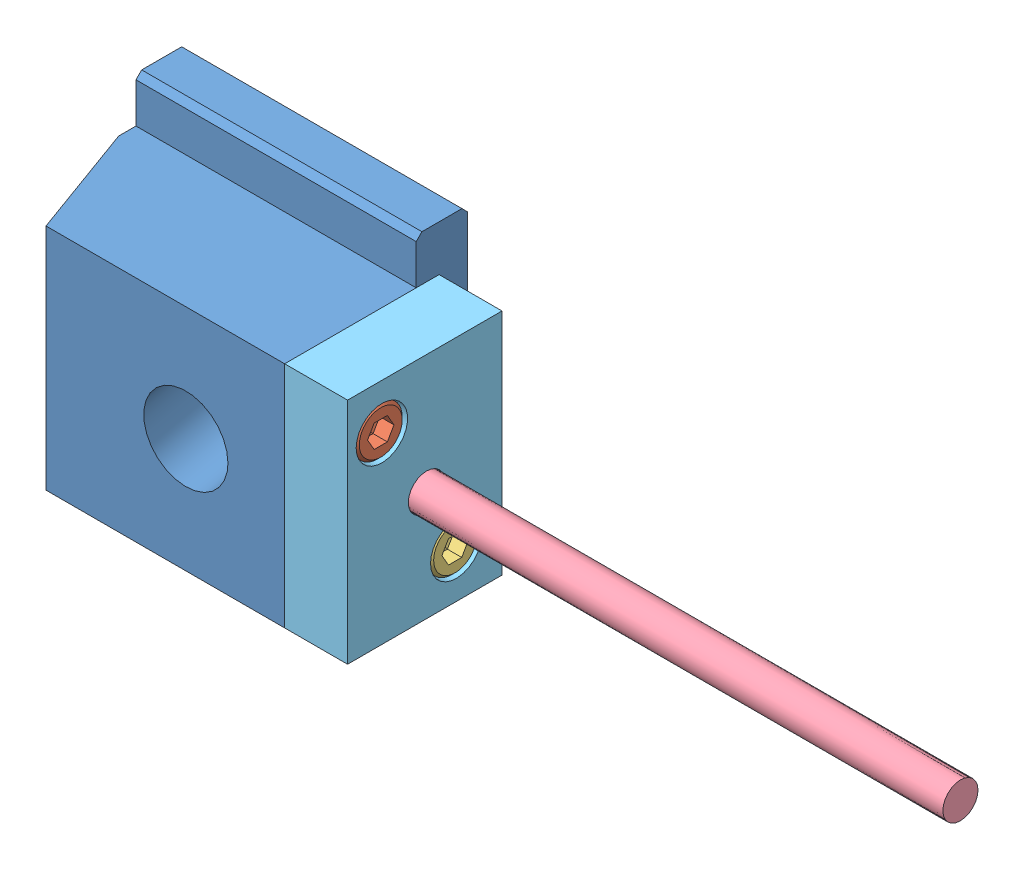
SolidWorks assembly Chariot gauche.SLDASM, configuration Défaut (file format 4700). Lengths in mm.
Overall size (153.37 56 32).
6 component instances, 6 part files, 5 mates.
Components (placement in the parent):
- moule machoire.sldasm-Part-156-1: moule machoire.sldasm-Part-156.sldprt [Défaut] at origin size (49 56 32)
- moule machoire.sldasm-Part-25-1: moule machoire.sldasm-Part-25.sldprt [Défaut] at origin size (20 8.5 8.5)
- moule machoire.sldasm-Part-15-1: moule machoire.sldasm-Part-15.sldprt [Défaut] at origin size (20 8.5 8.5)
- moule machoire.sldasm-Part-20-1: moule machoire.sldasm-Part-20.sldprt [Défaut] at origin size (102.57 12 12)
- moule machoire.sldasm-Part-17-3: moule machoire.sldasm-Part-17.sldprt [Défaut] at origin size (11 40 27)
- Rondelle Belleville-1: Rondelle Belleville.SLDPRT [Défaut] at (-121 -42.687 -15.81) x (0 -0.999846 0.017542) z (0 0.017542 0.999846) size (12.5 1.73 12.5)
Mates (geometry in assembly coordinates):
- Coïncidente2: coincident anti-aligned: plane of moule machoire.sldasm-Part-156-1 through (-121 -21.85 -40) normal (1 0 0); plane of moule machoire.sldasm-Part-17-3 through (-121 -61.85 -2) normal (-1 0 0)
- Coaxiale3: concentric anti-aligned: cylinder of moule machoire.sldasm-Part-25-1 through (-115.2 -29.85 -8) axis (1 0 0) radius 4.25; cylinder of moule machoire.sldasm-Part-17-3 through (-110 -29.85 -8) axis (-1 0 0) radius 4.5
- Coaxiale4: concentric anti-aligned: cylinder of moule machoire.sldasm-Part-15-1 through (-115.2 -53.85 -21) axis (1 0 0) radius 4.25; cylinder of moule machoire.sldasm-Part-17-3 through (-110 -53.85 -21) axis (-1 0 0) radius 4.5
- Coaxiale5: concentric anti-aligned: cylinder of moule machoire.sldasm-Part-17-3 through (-114.2 -42.687 -15.81) axis (-1 0 0) radius 6.5; cylinder of Rondelle Belleville-1 through (-99.7316 -42.687 -15.81) axis (1 0 0) radius 6.25
- Coïncidente3: coincident anti-aligned: plane of moule machoire.sldasm-Part-17-3 through (-121 -61.85 -2) normal (-1 0 0); circle of Rondelle Belleville-1
